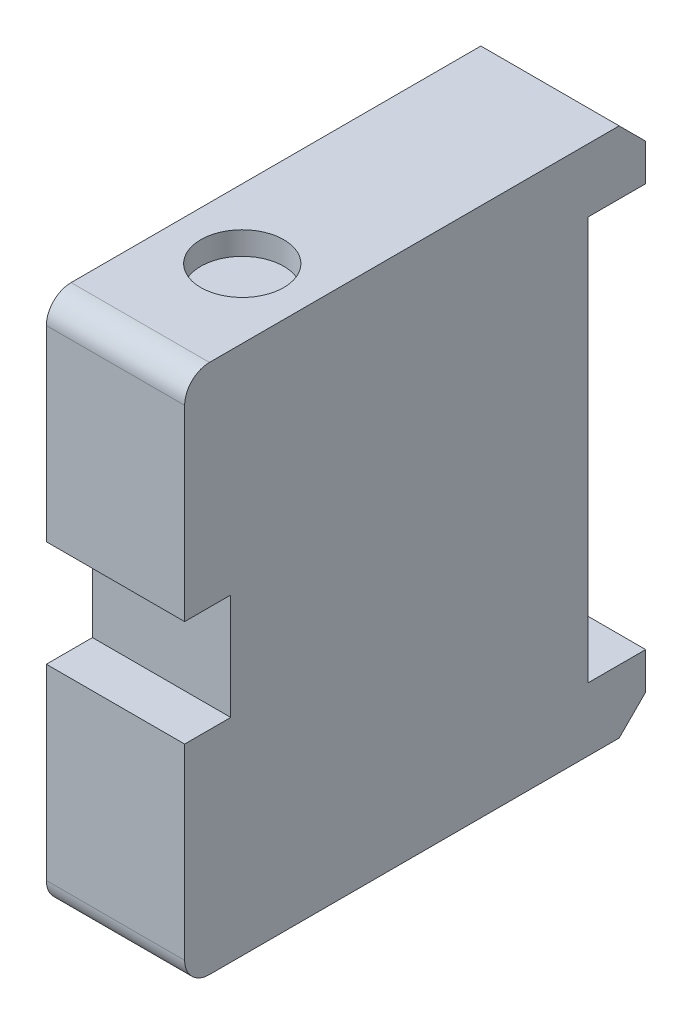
ISO-10303-21;
HEADER;
FILE_DESCRIPTION(('STEP AP214'),'2;1');
FILE_NAME('part.step','',(''),(''),'','','');
FILE_SCHEMA(('AUTOMOTIVE_DESIGN { 1 0 10303 214 1 1 1 1 }'));
ENDSEC;
DATA;
#1=APPLICATION_CONTEXT('core data for automotive mechanical design processes');
#2=APPLICATION_PROTOCOL_DEFINITION('international standard','automotive_design',2000,#1);
#3=PRODUCT_CONTEXT('',#1,'mechanical');
#4=PRODUCT('Part','Part','',(#3));
#5=PRODUCT_RELATED_PRODUCT_CATEGORY('part','',(#4));
#6=PRODUCT_DEFINITION_FORMATION('','',#4);
#7=PRODUCT_DEFINITION_CONTEXT('part definition',#1,'design');
#8=PRODUCT_DEFINITION('design','',#6,#7);
#9=PRODUCT_DEFINITION_SHAPE('','',#8);
#10=(LENGTH_UNIT() NAMED_UNIT(*) SI_UNIT(.MILLI.,.METRE.));
#11=(NAMED_UNIT(*) PLANE_ANGLE_UNIT() SI_UNIT($,.RADIAN.));
#12=(NAMED_UNIT(*) SI_UNIT($,.STERADIAN.) SOLID_ANGLE_UNIT());
#13=UNCERTAINTY_MEASURE_WITH_UNIT(LENGTH_MEASURE(1.E-05),#10,'distance_accuracy_value','');
#14=(GEOMETRIC_REPRESENTATION_CONTEXT(3) GLOBAL_UNCERTAINTY_ASSIGNED_CONTEXT((#13)) GLOBAL_UNIT_ASSIGNED_CONTEXT((#10,
#11,#12)) REPRESENTATION_CONTEXT('',''));
#15=CARTESIAN_POINT('',(0.,0.,0.));
#16=DIRECTION('',(0.,0.,1.));
#17=DIRECTION('',(1.,0.,0.));
#18=AXIS2_PLACEMENT_3D('',#15,#16,#17);
#19=CARTESIAN_POINT('',(-12.,-57.3880811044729,15.));
#20=DIRECTION('',(-1.,0.,0.));
#21=DIRECTION('',(0.,0.,1.));
#22=AXIS2_PLACEMENT_3D('',#19,#20,#21);
#23=PLANE('',#22);
#24=DIRECTION('',(0.,-1.,0.));
#25=VECTOR('',#24,1.);
#26=CARTESIAN_POINT('',(-12.,-17.5,0.));
#27=LINE('',#26,#25);
#28=CARTESIAN_POINT('',(-12.,17.5,0.));
#29=VERTEX_POINT('',#28);
#30=CARTESIAN_POINT('',(-12.,-17.5,0.));
#31=VERTEX_POINT('',#30);
#32=EDGE_CURVE('E141',#29,#31,#27,.T.);
#33=ORIENTED_EDGE('',*,*,#32,.T.);
#34=DIRECTION('',(0.,0.,-1.));
#35=VECTOR('',#34,1.);
#36=CARTESIAN_POINT('',(-12.,-17.5,0.));
#37=LINE('',#36,#35);
#38=CARTESIAN_POINT('',(-12.,-17.5,-5.));
#39=VERTEX_POINT('',#38);
#40=EDGE_CURVE('E41',#31,#39,#37,.T.);
#41=ORIENTED_EDGE('',*,*,#40,.T.);
#42=DIRECTION('',(0.,-1.,0.));
#43=VECTOR('',#42,1.);
#44=CARTESIAN_POINT('',(-12.,-17.5,-5.));
#45=LINE('',#44,#43);
#46=CARTESIAN_POINT('',(-12.,-20.7,-5.));
#47=VERTEX_POINT('',#46);
#48=EDGE_CURVE('E179',#39,#47,#45,.T.);
#49=ORIENTED_EDGE('',*,*,#48,.T.);
#50=DIRECTION('',(0.,-0.707106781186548,0.707106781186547));
#51=VECTOR('',#50,1.);
#52=CARTESIAN_POINT('',(-12.,-20.7,-5.));
#53=LINE('',#52,#51);
#54=CARTESIAN_POINT('',(-12.,-23.,-2.7));
#55=VERTEX_POINT('',#54);
#56=EDGE_CURVE('E188',#47,#55,#53,.T.);
#57=ORIENTED_EDGE('',*,*,#56,.T.);
#58=DIRECTION('',(0.,0.,1.));
#59=VECTOR('',#58,1.);
#60=CARTESIAN_POINT('',(-12.,-23.,32.85));
#61=LINE('',#60,#59);
#62=CARTESIAN_POINT('',(-12.,-23.,32.85));
#63=VERTEX_POINT('',#62);
#64=EDGE_CURVE('E202',#55,#63,#61,.T.);
#65=ORIENTED_EDGE('',*,*,#64,.T.);
#66=CARTESIAN_POINT('',(-12.,-20.85,32.85));
#67=DIRECTION('',(-1.,0.,0.));
#68=DIRECTION('',(0.,0.,-1.));
#69=AXIS2_PLACEMENT_3D('',#66,#67,#68);
#70=CIRCLE('',#69,2.15);
#71=CARTESIAN_POINT('',(-12.,-20.85,35.));
#72=VERTEX_POINT('',#71);
#73=EDGE_CURVE('E216',#63,#72,#70,.T.);
#74=ORIENTED_EDGE('',*,*,#73,.T.);
#75=DIRECTION('',(0.,1.,0.));
#76=VECTOR('',#75,1.);
#77=CARTESIAN_POINT('',(-12.,-4.6,35.));
#78=LINE('',#77,#76);
#79=CARTESIAN_POINT('',(-12.,-4.6,35.));
#80=VERTEX_POINT('',#79);
#81=EDGE_CURVE('E230',#72,#80,#78,.T.);
#82=ORIENTED_EDGE('',*,*,#81,.T.);
#83=DIRECTION('',(0.,0.,-1.));
#84=VECTOR('',#83,1.);
#85=CARTESIAN_POINT('',(-12.,-4.6,31.));
#86=LINE('',#85,#84);
#87=CARTESIAN_POINT('',(-12.,-4.6,31.));
#88=VERTEX_POINT('',#87);
#89=EDGE_CURVE('E244',#80,#88,#86,.T.);
#90=ORIENTED_EDGE('',*,*,#89,.T.);
#91=DIRECTION('',(0.,1.,0.));
#92=VECTOR('',#91,1.);
#93=CARTESIAN_POINT('',(-12.,4.6,31.));
#94=LINE('',#93,#92);
#95=CARTESIAN_POINT('',(-12.,4.6,31.));
#96=VERTEX_POINT('',#95);
#97=EDGE_CURVE('E258',#88,#96,#94,.T.);
#98=ORIENTED_EDGE('',*,*,#97,.T.);
#99=DIRECTION('',(0.,0.,1.));
#100=VECTOR('',#99,1.);
#101=CARTESIAN_POINT('',(-12.,4.6,35.));
#102=LINE('',#101,#100);
#103=CARTESIAN_POINT('',(-12.,4.6,35.));
#104=VERTEX_POINT('',#103);
#105=EDGE_CURVE('E272',#96,#104,#102,.T.);
#106=ORIENTED_EDGE('',*,*,#105,.T.);
#107=DIRECTION('',(0.,1.,0.));
#108=VECTOR('',#107,1.);
#109=CARTESIAN_POINT('',(-12.,20.85,35.));
#110=LINE('',#109,#108);
#111=CARTESIAN_POINT('',(-12.,20.85,35.));
#112=VERTEX_POINT('',#111);
#113=EDGE_CURVE('E286',#104,#112,#110,.T.);
#114=ORIENTED_EDGE('',*,*,#113,.T.);
#115=CARTESIAN_POINT('',(-12.,20.85,32.85));
#116=DIRECTION('',(-1.,0.,0.));
#117=DIRECTION('',(0.,0.,-1.));
#118=AXIS2_PLACEMENT_3D('',#115,#116,#117);
#119=CIRCLE('',#118,2.15);
#120=CARTESIAN_POINT('',(-12.,23.,32.85));
#121=VERTEX_POINT('',#120);
#122=EDGE_CURVE('E300',#112,#121,#119,.T.);
#123=ORIENTED_EDGE('',*,*,#122,.T.);
#124=DIRECTION('',(0.,0.,-1.));
#125=VECTOR('',#124,1.);
#126=CARTESIAN_POINT('',(-12.,23.,-2.7));
#127=LINE('',#126,#125);
#128=CARTESIAN_POINT('',(-12.,23.,-2.7));
#129=VERTEX_POINT('',#128);
#130=EDGE_CURVE('E314',#121,#129,#127,.T.);
#131=ORIENTED_EDGE('',*,*,#130,.T.);
#132=DIRECTION('',(0.,-0.707106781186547,-0.707106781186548));
#133=VECTOR('',#132,1.);
#134=CARTESIAN_POINT('',(-12.,20.7,-5.));
#135=LINE('',#134,#133);
#136=CARTESIAN_POINT('',(-12.,20.7,-5.));
#137=VERTEX_POINT('',#136);
#138=EDGE_CURVE('E328',#129,#137,#135,.T.);
#139=ORIENTED_EDGE('',*,*,#138,.T.);
#140=DIRECTION('',(0.,-1.,0.));
#141=VECTOR('',#140,1.);
#142=CARTESIAN_POINT('',(-12.,17.5,-5.));
#143=LINE('',#142,#141);
#144=CARTESIAN_POINT('',(-12.,17.5,-5.));
#145=VERTEX_POINT('',#144);
#146=EDGE_CURVE('E147',#137,#145,#143,.T.);
#147=ORIENTED_EDGE('',*,*,#146,.T.);
#148=DIRECTION('',(0.,0.,1.));
#149=VECTOR('',#148,1.);
#150=CARTESIAN_POINT('',(-12.,17.5,0.));
#151=LINE('',#150,#149);
#152=EDGE_CURVE('E144',#145,#29,#151,.T.);
#153=ORIENTED_EDGE('',*,*,#152,.T.);
#154=EDGE_LOOP('',(#33,#41,#49,#57,#65,#74,#82,#90,#98,#106,#114,#123,#131,#139,#147,#153));
#155=FACE_BOUND('',#154,.T.);
#156=ADVANCED_FACE('F32',(#155),#23,.T.);
#157=CARTESIAN_POINT('',(0.,-57.3880811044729,15.));
#158=DIRECTION('',(-1.,0.,0.));
#159=DIRECTION('',(0.,0.,1.));
#160=AXIS2_PLACEMENT_3D('',#157,#158,#159);
#161=PLANE('',#160);
#162=DIRECTION('',(0.,-1.,0.));
#163=VECTOR('',#162,1.);
#164=CARTESIAN_POINT('',(0.,-17.5,0.));
#165=LINE('',#164,#163);
#166=CARTESIAN_POINT('',(0.,17.5,0.));
#167=VERTEX_POINT('',#166);
#168=CARTESIAN_POINT('',(0.,-17.5,0.));
#169=VERTEX_POINT('',#168);
#170=EDGE_CURVE('E161',#167,#169,#165,.T.);
#171=ORIENTED_EDGE('',*,*,#170,.F.);
#172=DIRECTION('',(0.,0.,1.));
#173=VECTOR('',#172,1.);
#174=CARTESIAN_POINT('',(0.,17.5,0.));
#175=LINE('',#174,#173);
#176=CARTESIAN_POINT('',(0.,17.5,-5.));
#177=VERTEX_POINT('',#176);
#178=EDGE_CURVE('E158',#177,#167,#175,.T.);
#179=ORIENTED_EDGE('',*,*,#178,.F.);
#180=DIRECTION('',(0.,-1.,0.));
#181=VECTOR('',#180,1.);
#182=CARTESIAN_POINT('',(0.,17.5,-5.));
#183=LINE('',#182,#181);
#184=CARTESIAN_POINT('',(0.,20.7,-5.));
#185=VERTEX_POINT('',#184);
#186=EDGE_CURVE('E336',#185,#177,#183,.T.);
#187=ORIENTED_EDGE('',*,*,#186,.F.);
#188=DIRECTION('',(0.,-0.707106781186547,-0.707106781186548));
#189=VECTOR('',#188,1.);
#190=CARTESIAN_POINT('',(0.,20.7,-5.));
#191=LINE('',#190,#189);
#192=CARTESIAN_POINT('',(0.,23.,-2.7));
#193=VERTEX_POINT('',#192);
#194=EDGE_CURVE('E322',#193,#185,#191,.T.);
#195=ORIENTED_EDGE('',*,*,#194,.F.);
#196=DIRECTION('',(0.,0.,-1.));
#197=VECTOR('',#196,1.);
#198=CARTESIAN_POINT('',(0.,23.,-2.7));
#199=LINE('',#198,#197);
#200=CARTESIAN_POINT('',(0.,23.,32.85));
#201=VERTEX_POINT('',#200);
#202=EDGE_CURVE('E308',#201,#193,#199,.T.);
#203=ORIENTED_EDGE('',*,*,#202,.F.);
#204=CARTESIAN_POINT('',(0.,20.85,32.85));
#205=DIRECTION('',(-1.,0.,0.));
#206=DIRECTION('',(0.,0.,-1.));
#207=AXIS2_PLACEMENT_3D('',#204,#205,#206);
#208=CIRCLE('',#207,2.15);
#209=CARTESIAN_POINT('',(0.,20.85,35.));
#210=VERTEX_POINT('',#209);
#211=EDGE_CURVE('E294',#210,#201,#208,.T.);
#212=ORIENTED_EDGE('',*,*,#211,.F.);
#213=DIRECTION('',(0.,1.,0.));
#214=VECTOR('',#213,1.);
#215=CARTESIAN_POINT('',(0.,20.85,35.));
#216=LINE('',#215,#214);
#217=CARTESIAN_POINT('',(0.,4.6,35.));
#218=VERTEX_POINT('',#217);
#219=EDGE_CURVE('E280',#218,#210,#216,.T.);
#220=ORIENTED_EDGE('',*,*,#219,.F.);
#221=DIRECTION('',(0.,0.,1.));
#222=VECTOR('',#221,1.);
#223=CARTESIAN_POINT('',(0.,4.6,35.));
#224=LINE('',#223,#222);
#225=CARTESIAN_POINT('',(0.,4.6,31.));
#226=VERTEX_POINT('',#225);
#227=EDGE_CURVE('E266',#226,#218,#224,.T.);
#228=ORIENTED_EDGE('',*,*,#227,.F.);
#229=DIRECTION('',(0.,1.,0.));
#230=VECTOR('',#229,1.);
#231=CARTESIAN_POINT('',(0.,4.6,31.));
#232=LINE('',#231,#230);
#233=CARTESIAN_POINT('',(0.,-4.6,31.));
#234=VERTEX_POINT('',#233);
#235=EDGE_CURVE('E252',#234,#226,#232,.T.);
#236=ORIENTED_EDGE('',*,*,#235,.F.);
#237=DIRECTION('',(0.,0.,-1.));
#238=VECTOR('',#237,1.);
#239=CARTESIAN_POINT('',(0.,-4.6,31.));
#240=LINE('',#239,#238);
#241=CARTESIAN_POINT('',(0.,-4.6,35.));
#242=VERTEX_POINT('',#241);
#243=EDGE_CURVE('E238',#242,#234,#240,.T.);
#244=ORIENTED_EDGE('',*,*,#243,.F.);
#245=DIRECTION('',(0.,1.,0.));
#246=VECTOR('',#245,1.);
#247=CARTESIAN_POINT('',(0.,-4.6,35.));
#248=LINE('',#247,#246);
#249=CARTESIAN_POINT('',(0.,-20.85,35.));
#250=VERTEX_POINT('',#249);
#251=EDGE_CURVE('E224',#250,#242,#248,.T.);
#252=ORIENTED_EDGE('',*,*,#251,.F.);
#253=CARTESIAN_POINT('',(0.,-20.85,32.85));
#254=DIRECTION('',(-1.,0.,0.));
#255=DIRECTION('',(0.,0.,-1.));
#256=AXIS2_PLACEMENT_3D('',#253,#254,#255);
#257=CIRCLE('',#256,2.15);
#258=CARTESIAN_POINT('',(0.,-23.,32.85));
#259=VERTEX_POINT('',#258);
#260=EDGE_CURVE('E210',#259,#250,#257,.T.);
#261=ORIENTED_EDGE('',*,*,#260,.F.);
#262=DIRECTION('',(0.,0.,1.));
#263=VECTOR('',#262,1.);
#264=CARTESIAN_POINT('',(0.,-23.,32.85));
#265=LINE('',#264,#263);
#266=CARTESIAN_POINT('',(0.,-23.,-2.7));
#267=VERTEX_POINT('',#266);
#268=EDGE_CURVE('E196',#267,#259,#265,.T.);
#269=ORIENTED_EDGE('',*,*,#268,.F.);
#270=DIRECTION('',(0.,-0.707106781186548,0.707106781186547));
#271=VECTOR('',#270,1.);
#272=CARTESIAN_POINT('',(0.,-20.7,-5.));
#273=LINE('',#272,#271);
#274=CARTESIAN_POINT('',(0.,-20.7,-5.));
#275=VERTEX_POINT('',#274);
#276=EDGE_CURVE('E182',#275,#267,#273,.T.);
#277=ORIENTED_EDGE('',*,*,#276,.F.);
#278=DIRECTION('',(0.,-1.,0.));
#279=VECTOR('',#278,1.);
#280=CARTESIAN_POINT('',(0.,-17.5,-5.));
#281=LINE('',#280,#279);
#282=CARTESIAN_POINT('',(0.,-17.5,-5.));
#283=VERTEX_POINT('',#282);
#284=EDGE_CURVE('E50',#283,#275,#281,.T.);
#285=ORIENTED_EDGE('',*,*,#284,.F.);
#286=DIRECTION('',(0.,0.,-1.));
#287=VECTOR('',#286,1.);
#288=CARTESIAN_POINT('',(0.,-17.5,0.));
#289=LINE('',#288,#287);
#290=EDGE_CURVE('E12',#169,#283,#289,.T.);
#291=ORIENTED_EDGE('',*,*,#290,.F.);
#292=EDGE_LOOP('',(#171,#179,#187,#195,#203,#212,#220,#228,#236,#244,#252,#261,#269,#277,#285,#291));
#293=FACE_BOUND('',#292,.T.);
#294=ADVANCED_FACE('F361',(#293),#161,.F.);
#295=CARTESIAN_POINT('',(0.,-17.5,0.));
#296=DIRECTION('',(0.,0.,-1.));
#297=DIRECTION('',(-1.,0.,0.));
#298=AXIS2_PLACEMENT_3D('',#295,#296,#297);
#299=PLANE('',#298);
#300=ORIENTED_EDGE('',*,*,#32,.F.);
#301=DIRECTION('',(-1.,0.,0.));
#302=VECTOR('',#301,1.);
#303=CARTESIAN_POINT('',(0.,17.5,0.));
#304=LINE('',#303,#302);
#305=EDGE_CURVE('E156',#167,#29,#304,.T.);
#306=ORIENTED_EDGE('',*,*,#305,.F.);
#307=ORIENTED_EDGE('',*,*,#170,.T.);
#308=DIRECTION('',(-1.,0.,0.));
#309=VECTOR('',#308,1.);
#310=CARTESIAN_POINT('',(0.,-17.5,0.));
#311=LINE('',#310,#309);
#312=EDGE_CURVE('E152',#169,#31,#311,.T.);
#313=ORIENTED_EDGE('',*,*,#312,.T.);
#314=EDGE_LOOP('',(#300,#306,#307,#313));
#315=FACE_BOUND('',#314,.T.);
#316=ADVANCED_FACE('F162',(#315),#299,.T.);
#317=CARTESIAN_POINT('',(0.,17.5,0.));
#318=DIRECTION('',(0.,-1.,0.));
#319=DIRECTION('',(0.,0.,-1.));
#320=AXIS2_PLACEMENT_3D('',#317,#318,#319);
#321=PLANE('',#320);
#322=ORIENTED_EDGE('',*,*,#152,.F.);
#323=DIRECTION('',(-1.,0.,0.));
#324=VECTOR('',#323,1.);
#325=CARTESIAN_POINT('',(0.,17.5,-5.));
#326=LINE('',#325,#324);
#327=EDGE_CURVE('E151',#177,#145,#326,.T.);
#328=ORIENTED_EDGE('',*,*,#327,.F.);
#329=ORIENTED_EDGE('',*,*,#178,.T.);
#330=ORIENTED_EDGE('',*,*,#305,.T.);
#331=EDGE_LOOP('',(#322,#328,#329,#330));
#332=FACE_BOUND('',#331,.T.);
#333=ADVANCED_FACE('F157',(#332),#321,.T.);
#334=CARTESIAN_POINT('',(0.,17.5,-5.));
#335=DIRECTION('',(0.,0.,-1.));
#336=DIRECTION('',(0.,1.,0.));
#337=AXIS2_PLACEMENT_3D('',#334,#335,#336);
#338=PLANE('',#337);
#339=ORIENTED_EDGE('',*,*,#146,.F.);
#340=DIRECTION('',(-1.,0.,0.));
#341=VECTOR('',#340,1.);
#342=CARTESIAN_POINT('',(0.,20.7,-5.));
#343=LINE('',#342,#341);
#344=EDGE_CURVE('E339',#185,#137,#343,.T.);
#345=ORIENTED_EDGE('',*,*,#344,.F.);
#346=ORIENTED_EDGE('',*,*,#186,.T.);
#347=ORIENTED_EDGE('',*,*,#327,.T.);
#348=EDGE_LOOP('',(#339,#345,#346,#347));
#349=FACE_BOUND('',#348,.T.);
#350=ADVANCED_FACE('F359',(#349),#338,.T.);
#351=CARTESIAN_POINT('',(0.,20.7,-5.));
#352=DIRECTION('',(0.,0.707106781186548,-0.707106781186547));
#353=DIRECTION('',(0.,0.707106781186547,0.707106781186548));
#354=AXIS2_PLACEMENT_3D('',#351,#352,#353);
#355=PLANE('',#354);
#356=ORIENTED_EDGE('',*,*,#138,.F.);
#357=DIRECTION('',(-1.,0.,0.));
#358=VECTOR('',#357,1.);
#359=CARTESIAN_POINT('',(0.,23.,-2.7));
#360=LINE('',#359,#358);
#361=EDGE_CURVE('E325',#193,#129,#360,.T.);
#362=ORIENTED_EDGE('',*,*,#361,.F.);
#363=ORIENTED_EDGE('',*,*,#194,.T.);
#364=ORIENTED_EDGE('',*,*,#344,.T.);
#365=EDGE_LOOP('',(#356,#362,#363,#364));
#366=FACE_BOUND('',#365,.T.);
#367=ADVANCED_FACE('F422',(#366),#355,.T.);
#368=CARTESIAN_POINT('',(0.,23.,-2.7));
#369=DIRECTION('',(0.,1.,0.));
#370=DIRECTION('',(0.,0.,1.));
#371=AXIS2_PLACEMENT_3D('',#368,#369,#370);
#372=PLANE('',#371);
#373=CARTESIAN_POINT('',(-6.,23.,24.));
#374=DIRECTION('',(0.,1.,0.));
#375=DIRECTION('',(0.,0.,1.));
#376=AXIS2_PLACEMENT_3D('',#373,#374,#375);
#377=CIRCLE('',#376,3.6);
#378=CARTESIAN_POINT('',(-6.,23.,27.6));
#379=VERTEX_POINT('',#378);
#380=EDGE_CURVE('E168',#379,#379,#377,.T.);
#381=ORIENTED_EDGE('',*,*,#380,.F.);
#382=EDGE_LOOP('',(#381));
#383=FACE_BOUND('',#382,.T.);
#384=ORIENTED_EDGE('',*,*,#130,.F.);
#385=DIRECTION('',(-1.,0.,0.));
#386=VECTOR('',#385,1.);
#387=CARTESIAN_POINT('',(0.,23.,32.85));
#388=LINE('',#387,#386);
#389=EDGE_CURVE('E311',#201,#121,#388,.T.);
#390=ORIENTED_EDGE('',*,*,#389,.F.);
#391=ORIENTED_EDGE('',*,*,#202,.T.);
#392=ORIENTED_EDGE('',*,*,#361,.T.);
#393=EDGE_LOOP('',(#384,#390,#391,#392));
#394=FACE_BOUND('',#393,.T.);
#395=ADVANCED_FACE('F420',(#383,#394),#372,.T.);
#396=CARTESIAN_POINT('',(0.,20.85,32.85));
#397=DIRECTION('',(-1.,0.,0.));
#398=DIRECTION('',(0.,0.,1.));
#399=AXIS2_PLACEMENT_3D('',#396,#397,#398);
#400=CYLINDRICAL_SURFACE('',#399,2.15);
#401=ORIENTED_EDGE('',*,*,#122,.F.);
#402=DIRECTION('',(-1.,0.,0.));
#403=VECTOR('',#402,1.);
#404=CARTESIAN_POINT('',(0.,20.85,35.));
#405=LINE('',#404,#403);
#406=EDGE_CURVE('E297',#210,#112,#405,.T.);
#407=ORIENTED_EDGE('',*,*,#406,.F.);
#408=ORIENTED_EDGE('',*,*,#211,.T.);
#409=ORIENTED_EDGE('',*,*,#389,.T.);
#410=EDGE_LOOP('',(#401,#407,#408,#409));
#411=FACE_BOUND('',#410,.T.);
#412=ADVANCED_FACE('F415',(#411),#400,.T.);
#413=CARTESIAN_POINT('',(0.,20.85,35.));
#414=DIRECTION('',(0.,0.,1.));
#415=DIRECTION('',(1.,0.,0.));
#416=AXIS2_PLACEMENT_3D('',#413,#414,#415);
#417=PLANE('',#416);
#418=ORIENTED_EDGE('',*,*,#113,.F.);
#419=DIRECTION('',(-1.,0.,0.));
#420=VECTOR('',#419,1.);
#421=CARTESIAN_POINT('',(0.,4.6,35.));
#422=LINE('',#421,#420);
#423=EDGE_CURVE('E283',#218,#104,#422,.T.);
#424=ORIENTED_EDGE('',*,*,#423,.F.);
#425=ORIENTED_EDGE('',*,*,#219,.T.);
#426=ORIENTED_EDGE('',*,*,#406,.T.);
#427=EDGE_LOOP('',(#418,#424,#425,#426));
#428=FACE_BOUND('',#427,.T.);
#429=ADVANCED_FACE('F411',(#428),#417,.T.);
#430=CARTESIAN_POINT('',(0.,4.6,35.));
#431=DIRECTION('',(0.,-1.,0.));
#432=DIRECTION('',(0.,0.,-1.));
#433=AXIS2_PLACEMENT_3D('',#430,#431,#432);
#434=PLANE('',#433);
#435=ORIENTED_EDGE('',*,*,#105,.F.);
#436=DIRECTION('',(-1.,0.,0.));
#437=VECTOR('',#436,1.);
#438=CARTESIAN_POINT('',(0.,4.6,31.));
#439=LINE('',#438,#437);
#440=EDGE_CURVE('E269',#226,#96,#439,.T.);
#441=ORIENTED_EDGE('',*,*,#440,.F.);
#442=ORIENTED_EDGE('',*,*,#227,.T.);
#443=ORIENTED_EDGE('',*,*,#423,.T.);
#444=EDGE_LOOP('',(#435,#441,#442,#443));
#445=FACE_BOUND('',#444,.T.);
#446=ADVANCED_FACE('F409',(#445),#434,.T.);
#447=CARTESIAN_POINT('',(0.,4.6,31.));
#448=DIRECTION('',(0.,0.,1.));
#449=DIRECTION('',(1.,0.,0.));
#450=AXIS2_PLACEMENT_3D('',#447,#448,#449);
#451=PLANE('',#450);
#452=ORIENTED_EDGE('',*,*,#97,.F.);
#453=DIRECTION('',(-1.,0.,0.));
#454=VECTOR('',#453,1.);
#455=CARTESIAN_POINT('',(0.,-4.6,31.));
#456=LINE('',#455,#454);
#457=EDGE_CURVE('E255',#234,#88,#456,.T.);
#458=ORIENTED_EDGE('',*,*,#457,.F.);
#459=ORIENTED_EDGE('',*,*,#235,.T.);
#460=ORIENTED_EDGE('',*,*,#440,.T.);
#461=EDGE_LOOP('',(#452,#458,#459,#460));
#462=FACE_BOUND('',#461,.T.);
#463=ADVANCED_FACE('F403',(#462),#451,.T.);
#464=CARTESIAN_POINT('',(0.,-4.6,31.));
#465=DIRECTION('',(0.,1.,0.));
#466=DIRECTION('',(0.,0.,1.));
#467=AXIS2_PLACEMENT_3D('',#464,#465,#466);
#468=PLANE('',#467);
#469=ORIENTED_EDGE('',*,*,#89,.F.);
#470=DIRECTION('',(-1.,0.,0.));
#471=VECTOR('',#470,1.);
#472=CARTESIAN_POINT('',(0.,-4.6,35.));
#473=LINE('',#472,#471);
#474=EDGE_CURVE('E241',#242,#80,#473,.T.);
#475=ORIENTED_EDGE('',*,*,#474,.F.);
#476=ORIENTED_EDGE('',*,*,#243,.T.);
#477=ORIENTED_EDGE('',*,*,#457,.T.);
#478=EDGE_LOOP('',(#469,#475,#476,#477));
#479=FACE_BOUND('',#478,.T.);
#480=ADVANCED_FACE('F399',(#479),#468,.T.);
#481=CARTESIAN_POINT('',(0.,-4.6,35.));
#482=DIRECTION('',(0.,0.,1.));
#483=DIRECTION('',(1.,0.,0.));
#484=AXIS2_PLACEMENT_3D('',#481,#482,#483);
#485=PLANE('',#484);
#486=ORIENTED_EDGE('',*,*,#81,.F.);
#487=DIRECTION('',(-1.,0.,0.));
#488=VECTOR('',#487,1.);
#489=CARTESIAN_POINT('',(0.,-20.85,35.));
#490=LINE('',#489,#488);
#491=EDGE_CURVE('E227',#250,#72,#490,.T.);
#492=ORIENTED_EDGE('',*,*,#491,.F.);
#493=ORIENTED_EDGE('',*,*,#251,.T.);
#494=ORIENTED_EDGE('',*,*,#474,.T.);
#495=EDGE_LOOP('',(#486,#492,#493,#494));
#496=FACE_BOUND('',#495,.T.);
#497=ADVANCED_FACE('F397',(#496),#485,.T.);
#498=CARTESIAN_POINT('',(0.,-20.85,32.85));
#499=DIRECTION('',(-1.,0.,0.));
#500=DIRECTION('',(0.,0.,1.));
#501=AXIS2_PLACEMENT_3D('',#498,#499,#500);
#502=CYLINDRICAL_SURFACE('',#501,2.15);
#503=ORIENTED_EDGE('',*,*,#73,.F.);
#504=DIRECTION('',(-1.,0.,0.));
#505=VECTOR('',#504,1.);
#506=CARTESIAN_POINT('',(0.,-23.,32.85));
#507=LINE('',#506,#505);
#508=EDGE_CURVE('E213',#259,#63,#507,.T.);
#509=ORIENTED_EDGE('',*,*,#508,.F.);
#510=ORIENTED_EDGE('',*,*,#260,.T.);
#511=ORIENTED_EDGE('',*,*,#491,.T.);
#512=EDGE_LOOP('',(#503,#509,#510,#511));
#513=FACE_BOUND('',#512,.T.);
#514=ADVANCED_FACE('F391',(#513),#502,.T.);
#515=CARTESIAN_POINT('',(0.,-23.,32.85));
#516=DIRECTION('',(0.,-1.,0.));
#517=DIRECTION('',(0.,0.,-1.));
#518=AXIS2_PLACEMENT_3D('',#515,#516,#517);
#519=PLANE('',#518);
#520=CARTESIAN_POINT('',(-6.,-23.,24.));
#521=DIRECTION('',(0.,-1.,0.));
#522=DIRECTION('',(0.,0.,-1.));
#523=AXIS2_PLACEMENT_3D('',#520,#521,#522);
#524=CIRCLE('',#523,3.6);
#525=CARTESIAN_POINT('',(-6.,-23.,20.4));
#526=VERTEX_POINT('',#525);
#527=EDGE_CURVE('E610',#526,#526,#524,.T.);
#528=ORIENTED_EDGE('',*,*,#527,.F.);
#529=EDGE_LOOP('',(#528));
#530=FACE_BOUND('',#529,.T.);
#531=ORIENTED_EDGE('',*,*,#64,.F.);
#532=DIRECTION('',(-1.,0.,0.));
#533=VECTOR('',#532,1.);
#534=CARTESIAN_POINT('',(0.,-23.,-2.7));
#535=LINE('',#534,#533);
#536=EDGE_CURVE('E199',#267,#55,#535,.T.);
#537=ORIENTED_EDGE('',*,*,#536,.F.);
#538=ORIENTED_EDGE('',*,*,#268,.T.);
#539=ORIENTED_EDGE('',*,*,#508,.T.);
#540=EDGE_LOOP('',(#531,#537,#538,#539));
#541=FACE_BOUND('',#540,.T.);
#542=ADVANCED_FACE('F387',(#530,#541),#519,.T.);
#543=CARTESIAN_POINT('',(0.,-20.7,-5.));
#544=DIRECTION('',(0.,-0.707106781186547,-0.707106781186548));
#545=DIRECTION('',(0.,0.707106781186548,-0.707106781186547));
#546=AXIS2_PLACEMENT_3D('',#543,#544,#545);
#547=PLANE('',#546);
#548=ORIENTED_EDGE('',*,*,#56,.F.);
#549=DIRECTION('',(-1.,0.,0.));
#550=VECTOR('',#549,1.);
#551=CARTESIAN_POINT('',(0.,-20.7,-5.));
#552=LINE('',#551,#550);
#553=EDGE_CURVE('E185',#275,#47,#552,.T.);
#554=ORIENTED_EDGE('',*,*,#553,.F.);
#555=ORIENTED_EDGE('',*,*,#276,.T.);
#556=ORIENTED_EDGE('',*,*,#536,.T.);
#557=EDGE_LOOP('',(#548,#554,#555,#556));
#558=FACE_BOUND('',#557,.T.);
#559=ADVANCED_FACE('F385',(#558),#547,.T.);
#560=CARTESIAN_POINT('',(0.,-17.5,-5.));
#561=DIRECTION('',(0.,0.,-1.));
#562=DIRECTION('',(0.,1.,0.));
#563=AXIS2_PLACEMENT_3D('',#560,#561,#562);
#564=PLANE('',#563);
#565=ORIENTED_EDGE('',*,*,#48,.F.);
#566=DIRECTION('',(-1.,0.,0.));
#567=VECTOR('',#566,1.);
#568=CARTESIAN_POINT('',(0.,-17.5,-5.));
#569=LINE('',#568,#567);
#570=EDGE_CURVE('E181',#283,#39,#569,.T.);
#571=ORIENTED_EDGE('',*,*,#570,.F.);
#572=ORIENTED_EDGE('',*,*,#284,.T.);
#573=ORIENTED_EDGE('',*,*,#553,.T.);
#574=EDGE_LOOP('',(#565,#571,#572,#573));
#575=FACE_BOUND('',#574,.T.);
#576=ADVANCED_FACE('F377',(#575),#564,.T.);
#577=CARTESIAN_POINT('',(0.,-17.5,0.));
#578=DIRECTION('',(0.,1.,0.));
#579=DIRECTION('',(0.,0.,1.));
#580=AXIS2_PLACEMENT_3D('',#577,#578,#579);
#581=PLANE('',#580);
#582=ORIENTED_EDGE('',*,*,#40,.F.);
#583=ORIENTED_EDGE('',*,*,#312,.F.);
#584=ORIENTED_EDGE('',*,*,#290,.T.);
#585=ORIENTED_EDGE('',*,*,#570,.T.);
#586=EDGE_LOOP('',(#582,#583,#584,#585));
#587=FACE_BOUND('',#586,.T.);
#588=ADVANCED_FACE('F381',(#587),#581,.T.);
#589=CARTESIAN_POINT('',(-6.,21.,24.));
#590=DIRECTION('',(0.,1.,0.));
#591=DIRECTION('',(0.,0.,1.));
#592=AXIS2_PLACEMENT_3D('',#589,#590,#591);
#593=CYLINDRICAL_SURFACE('',#592,3.6);
#594=CARTESIAN_POINT('',(-6.,21.,24.));
#595=DIRECTION('',(0.,1.,0.));
#596=DIRECTION('',(0.,0.,1.));
#597=AXIS2_PLACEMENT_3D('',#594,#595,#596);
#598=CIRCLE('',#597,3.6);
#599=CARTESIAN_POINT('',(-6.,21.,27.6));
#600=VERTEX_POINT('',#599);
#601=EDGE_CURVE('E165',#600,#600,#598,.T.);
#602=ORIENTED_EDGE('',*,*,#601,.F.);
#603=EDGE_LOOP('',(#602));
#604=FACE_BOUND('',#603,.T.);
#605=ORIENTED_EDGE('',*,*,#380,.T.);
#606=EDGE_LOOP('',(#605));
#607=FACE_BOUND('',#606,.T.);
#608=ADVANCED_FACE('F433',(#604,#607),#593,.F.);
#609=CARTESIAN_POINT('',(-6.,21.,24.));
#610=DIRECTION('',(0.,1.,0.));
#611=DIRECTION('',(0.,0.,1.));
#612=AXIS2_PLACEMENT_3D('',#609,#610,#611);
#613=PLANE('',#612);
#614=ORIENTED_EDGE('',*,*,#601,.T.);
#615=EDGE_LOOP('',(#614));
#616=FACE_BOUND('',#615,.T.);
#617=ADVANCED_FACE('F439',(#616),#613,.T.);
#618=CARTESIAN_POINT('',(-6.,-21.,24.));
#619=DIRECTION('',(0.,-1.,0.));
#620=DIRECTION('',(0.,0.,-1.));
#621=AXIS2_PLACEMENT_3D('',#618,#619,#620);
#622=CYLINDRICAL_SURFACE('',#621,3.6);
#623=CARTESIAN_POINT('',(-6.,-21.,24.));
#624=DIRECTION('',(0.,-1.,0.));
#625=DIRECTION('',(0.,0.,-1.));
#626=AXIS2_PLACEMENT_3D('',#623,#624,#625);
#627=CIRCLE('',#626,3.6);
#628=CARTESIAN_POINT('',(-6.,-21.,20.4));
#629=VERTEX_POINT('',#628);
#630=EDGE_CURVE('E609',#629,#629,#627,.T.);
#631=ORIENTED_EDGE('',*,*,#630,.F.);
#632=EDGE_LOOP('',(#631));
#633=FACE_BOUND('',#632,.T.);
#634=ORIENTED_EDGE('',*,*,#527,.T.);
#635=EDGE_LOOP('',(#634));
#636=FACE_BOUND('',#635,.T.);
#637=ADVANCED_FACE('F576',(#633,#636),#622,.F.);
#638=CARTESIAN_POINT('',(-6.,-21.,24.));
#639=DIRECTION('',(0.,-1.,0.));
#640=DIRECTION('',(0.,0.,-1.));
#641=AXIS2_PLACEMENT_3D('',#638,#639,#640);
#642=PLANE('',#641);
#643=ORIENTED_EDGE('',*,*,#630,.T.);
#644=EDGE_LOOP('',(#643));
#645=FACE_BOUND('',#644,.T.);
#646=ADVANCED_FACE('F593',(#645),#642,.T.);
#647=CLOSED_SHELL('',(#156,#294,#316,#333,#350,#367,#395,#412,#429,#446,#463,#480,#497,#514,
#542,#559,#576,#588,#608,#617,#637,#646));
#648=MANIFOLD_SOLID_BREP('B2',#647);
#649=ADVANCED_BREP_SHAPE_REPRESENTATION('',(#18,#648),#14);
#650=SHAPE_DEFINITION_REPRESENTATION(#9,#649);
ENDSEC;
END-ISO-10303-21;
